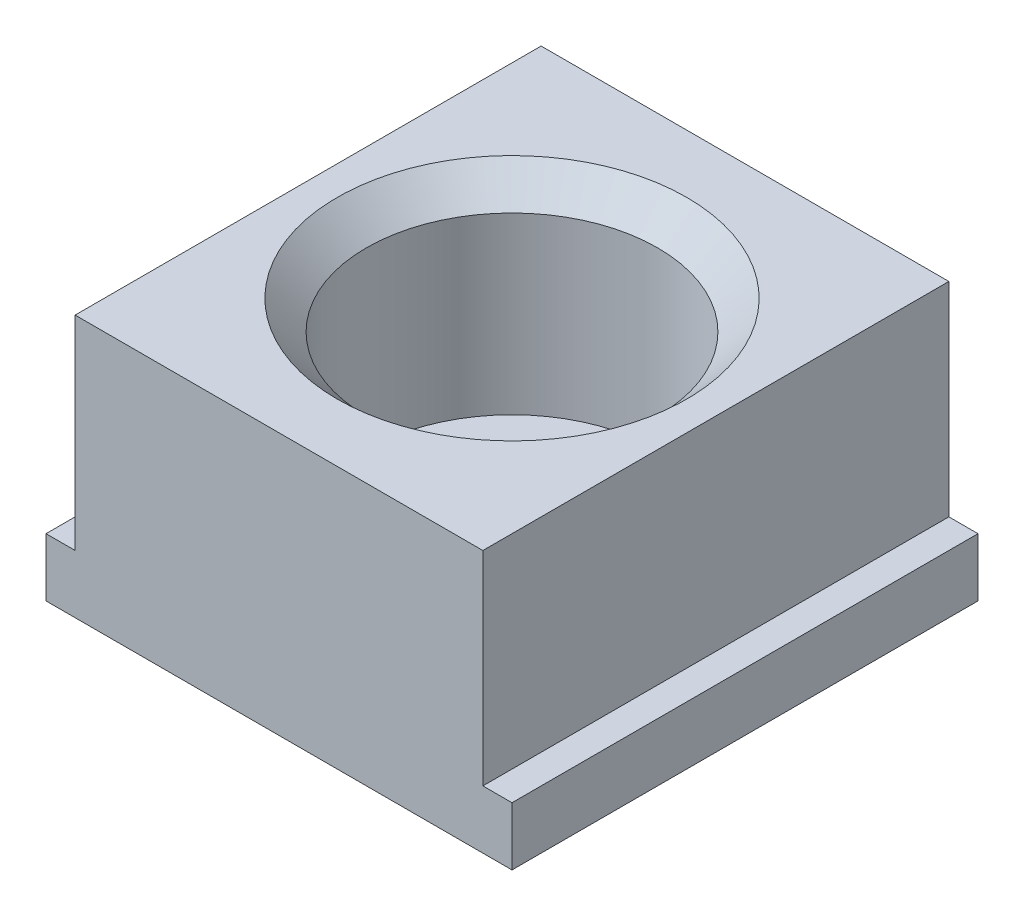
ISO-10303-21;
HEADER;
FILE_DESCRIPTION(('STEP AP214'),'2;1');
FILE_NAME('part.step','',(''),(''),'','','');
FILE_SCHEMA(('AUTOMOTIVE_DESIGN { 1 0 10303 214 1 1 1 1 }'));
ENDSEC;
DATA;
#1=APPLICATION_CONTEXT('core data for automotive mechanical design processes');
#2=APPLICATION_PROTOCOL_DEFINITION('international standard','automotive_design',2000,#1);
#3=PRODUCT_CONTEXT('',#1,'mechanical');
#4=PRODUCT('Part','Part','',(#3));
#5=PRODUCT_RELATED_PRODUCT_CATEGORY('part','',(#4));
#6=PRODUCT_DEFINITION_FORMATION('','',#4);
#7=PRODUCT_DEFINITION_CONTEXT('part definition',#1,'design');
#8=PRODUCT_DEFINITION('design','',#6,#7);
#9=PRODUCT_DEFINITION_SHAPE('','',#8);
#10=(LENGTH_UNIT() NAMED_UNIT(*) SI_UNIT(.MILLI.,.METRE.));
#11=(NAMED_UNIT(*) PLANE_ANGLE_UNIT() SI_UNIT($,.RADIAN.));
#12=(NAMED_UNIT(*) SI_UNIT($,.STERADIAN.) SOLID_ANGLE_UNIT());
#13=UNCERTAINTY_MEASURE_WITH_UNIT(LENGTH_MEASURE(1.E-05),#10,'distance_accuracy_value','');
#14=(GEOMETRIC_REPRESENTATION_CONTEXT(3) GLOBAL_UNCERTAINTY_ASSIGNED_CONTEXT((#13)) GLOBAL_UNIT_ASSIGNED_CONTEXT((#10,
#11,#12)) REPRESENTATION_CONTEXT('',''));
#15=CARTESIAN_POINT('',(0.,0.,0.));
#16=DIRECTION('',(0.,0.,1.));
#17=DIRECTION('',(1.,0.,0.));
#18=AXIS2_PLACEMENT_3D('',#15,#16,#17);
#19=CARTESIAN_POINT('',(0.,0.,7.99999999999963));
#20=DIRECTION('',(1.,0.,0.));
#21=DIRECTION('',(0.,0.,-1.));
#22=AXIS2_PLACEMENT_3D('',#19,#20,#21);
#23=PLANE('',#22);
#24=DIRECTION('',(0.,-1.,0.));
#25=VECTOR('',#24,1.);
#26=CARTESIAN_POINT('',(0.,0.,-8.00000000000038));
#27=LINE('',#26,#25);
#28=CARTESIAN_POINT('',(0.,2.,-8.00000000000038));
#29=VERTEX_POINT('',#28);
#30=CARTESIAN_POINT('',(0.,0.,-8.00000000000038));
#31=VERTEX_POINT('',#30);
#32=EDGE_CURVE('E417',#29,#31,#27,.T.);
#33=ORIENTED_EDGE('',*,*,#32,.T.);
#34=DIRECTION('',(0.,0.,-1.));
#35=VECTOR('',#34,1.);
#36=CARTESIAN_POINT('',(0.,0.,7.99999999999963));
#37=LINE('',#36,#35);
#38=CARTESIAN_POINT('',(0.,0.,7.99999999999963));
#39=VERTEX_POINT('',#38);
#40=EDGE_CURVE('E425',#39,#31,#37,.T.);
#41=ORIENTED_EDGE('',*,*,#40,.F.);
#42=DIRECTION('',(0.,-1.,0.));
#43=VECTOR('',#42,1.);
#44=CARTESIAN_POINT('',(0.,0.,7.99999999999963));
#45=LINE('',#44,#43);
#46=CARTESIAN_POINT('',(0.,2.,7.99999999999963));
#47=VERTEX_POINT('',#46);
#48=EDGE_CURVE('E453',#47,#39,#45,.T.);
#49=ORIENTED_EDGE('',*,*,#48,.F.);
#50=DIRECTION('',(0.,0.,-1.));
#51=VECTOR('',#50,1.);
#52=CARTESIAN_POINT('',(0.,2.,7.99999999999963));
#53=LINE('',#52,#51);
#54=EDGE_CURVE('E434',#47,#29,#53,.T.);
#55=ORIENTED_EDGE('',*,*,#54,.T.);
#56=EDGE_LOOP('',(#33,#41,#49,#55));
#57=FACE_BOUND('',#56,.T.);
#58=ADVANCED_FACE('F348',(#57),#23,.F.);
#59=CARTESIAN_POINT('',(0.,0.,7.99999999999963));
#60=DIRECTION('',(0.,1.,0.));
#61=DIRECTION('',(0.,0.,1.));
#62=AXIS2_PLACEMENT_3D('',#59,#60,#61);
#63=PLANE('',#62);
#64=CARTESIAN_POINT('',(7.99999999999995,0.,-3.7470027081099E-13));
#65=DIRECTION('',(0.,1.,0.));
#66=DIRECTION('',(0.,0.,1.));
#67=AXIS2_PLACEMENT_3D('',#64,#65,#66);
#68=CIRCLE('',#67,4.30000000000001);
#69=CARTESIAN_POINT('',(7.99999999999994,0.,4.29999999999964));
#70=VERTEX_POINT('',#69);
#71=EDGE_CURVE('E430',#70,#70,#68,.T.);
#72=ORIENTED_EDGE('',*,*,#71,.T.);
#73=EDGE_LOOP('',(#72));
#74=FACE_BOUND('',#73,.T.);
#75=DIRECTION('',(1.,0.,0.));
#76=VECTOR('',#75,1.);
#77=CARTESIAN_POINT('',(0.,0.,-8.00000000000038));
#78=LINE('',#77,#76);
#79=CARTESIAN_POINT('',(16.,-1.87350135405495E-13,-8.00000000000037));
#80=VERTEX_POINT('',#79);
#81=EDGE_CURVE('E412',#31,#80,#78,.T.);
#82=ORIENTED_EDGE('',*,*,#81,.T.);
#83=DIRECTION('',(0.,0.,-1.));
#84=VECTOR('',#83,1.);
#85=CARTESIAN_POINT('',(16.,0.,7.99999999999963));
#86=LINE('',#85,#84);
#87=CARTESIAN_POINT('',(16.,0.,7.99999999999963));
#88=VERTEX_POINT('',#87);
#89=EDGE_CURVE('E431',#88,#80,#86,.T.);
#90=ORIENTED_EDGE('',*,*,#89,.F.);
#91=DIRECTION('',(1.,0.,0.));
#92=VECTOR('',#91,1.);
#93=CARTESIAN_POINT('',(0.,0.,7.99999999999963));
#94=LINE('',#93,#92);
#95=EDGE_CURVE('E427',#39,#88,#94,.T.);
#96=ORIENTED_EDGE('',*,*,#95,.F.);
#97=ORIENTED_EDGE('',*,*,#40,.T.);
#98=EDGE_LOOP('',(#82,#90,#96,#97));
#99=FACE_BOUND('',#98,.T.);
#100=ADVANCED_FACE('F426',(#74,#99),#63,.F.);
#101=CARTESIAN_POINT('',(16.,0.,7.99999999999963));
#102=DIRECTION('',(-1.,0.,0.));
#103=DIRECTION('',(0.,0.,1.));
#104=AXIS2_PLACEMENT_3D('',#101,#102,#103);
#105=PLANE('',#104);
#106=DIRECTION('',(0.,1.,0.));
#107=VECTOR('',#106,1.);
#108=CARTESIAN_POINT('',(16.,-1.87350135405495E-13,-8.00000000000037));
#109=LINE('',#108,#107);
#110=CARTESIAN_POINT('',(16.,1.99999999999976,-8.00000000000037));
#111=VERTEX_POINT('',#110);
#112=EDGE_CURVE('E419',#80,#111,#109,.T.);
#113=ORIENTED_EDGE('',*,*,#112,.T.);
#114=DIRECTION('',(0.,0.,-1.));
#115=VECTOR('',#114,1.);
#116=CARTESIAN_POINT('',(16.,1.99999999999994,7.99999999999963));
#117=LINE('',#116,#115);
#118=CARTESIAN_POINT('',(16.,1.99999999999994,7.99999999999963));
#119=VERTEX_POINT('',#118);
#120=EDGE_CURVE('E479',#119,#111,#117,.T.);
#121=ORIENTED_EDGE('',*,*,#120,.F.);
#122=DIRECTION('',(0.,1.,0.));
#123=VECTOR('',#122,1.);
#124=CARTESIAN_POINT('',(16.,0.,7.99999999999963));
#125=LINE('',#124,#123);
#126=EDGE_CURVE('E456',#88,#119,#125,.T.);
#127=ORIENTED_EDGE('',*,*,#126,.F.);
#128=ORIENTED_EDGE('',*,*,#89,.T.);
#129=EDGE_LOOP('',(#113,#121,#127,#128));
#130=FACE_BOUND('',#129,.T.);
#131=ADVANCED_FACE('F509',(#130),#105,.F.);
#132=CARTESIAN_POINT('',(16.,1.99999999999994,7.99999999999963));
#133=DIRECTION('',(0.,-1.,0.));
#134=DIRECTION('',(0.,0.,-1.));
#135=AXIS2_PLACEMENT_3D('',#132,#133,#134);
#136=PLANE('',#135);
#137=DIRECTION('',(-1.,0.,0.));
#138=VECTOR('',#137,1.);
#139=CARTESIAN_POINT('',(16.,1.99999999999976,-8.00000000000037));
#140=LINE('',#139,#138);
#141=CARTESIAN_POINT('',(15.,1.99999999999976,-8.00000000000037));
#142=VERTEX_POINT('',#141);
#143=EDGE_CURVE('E443',#111,#142,#140,.T.);
#144=ORIENTED_EDGE('',*,*,#143,.T.);
#145=DIRECTION('',(0.,0.,-1.));
#146=VECTOR('',#145,1.);
#147=CARTESIAN_POINT('',(14.9999999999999,1.99999999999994,7.99999999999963));
#148=LINE('',#147,#146);
#149=CARTESIAN_POINT('',(14.9999999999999,1.99999999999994,7.99999999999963));
#150=VERTEX_POINT('',#149);
#151=EDGE_CURVE('E476',#150,#142,#148,.T.);
#152=ORIENTED_EDGE('',*,*,#151,.F.);
#153=DIRECTION('',(-1.,0.,0.));
#154=VECTOR('',#153,1.);
#155=CARTESIAN_POINT('',(16.,1.99999999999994,7.99999999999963));
#156=LINE('',#155,#154);
#157=EDGE_CURVE('E458',#119,#150,#156,.T.);
#158=ORIENTED_EDGE('',*,*,#157,.F.);
#159=ORIENTED_EDGE('',*,*,#120,.T.);
#160=EDGE_LOOP('',(#144,#152,#158,#159));
#161=FACE_BOUND('',#160,.T.);
#162=ADVANCED_FACE('F514',(#161),#136,.F.);
#163=CARTESIAN_POINT('',(14.9999999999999,9.,8.00000000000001));
#164=DIRECTION('',(-1.,0.,0.));
#165=DIRECTION('',(0.,-1.,0.));
#166=AXIS2_PLACEMENT_3D('',#163,#164,#165);
#167=PLANE('',#166);
#168=DIRECTION('',(0.,1.,0.));
#169=VECTOR('',#168,1.);
#170=CARTESIAN_POINT('',(14.9999999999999,8.99999999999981,-7.99999999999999));
#171=LINE('',#170,#169);
#172=CARTESIAN_POINT('',(14.9999999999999,8.99999999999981,-7.99999999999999));
#173=VERTEX_POINT('',#172);
#174=EDGE_CURVE('E445',#142,#173,#171,.T.);
#175=ORIENTED_EDGE('',*,*,#174,.T.);
#176=DIRECTION('',(0.,0.,-1.));
#177=VECTOR('',#176,1.);
#178=CARTESIAN_POINT('',(14.9999999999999,9.,8.00000000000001));
#179=LINE('',#178,#177);
#180=CARTESIAN_POINT('',(14.9999999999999,9.,8.00000000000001));
#181=VERTEX_POINT('',#180);
#182=EDGE_CURVE('E473',#181,#173,#179,.T.);
#183=ORIENTED_EDGE('',*,*,#182,.F.);
#184=DIRECTION('',(0.,1.,0.));
#185=VECTOR('',#184,1.);
#186=CARTESIAN_POINT('',(14.9999999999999,9.,8.00000000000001));
#187=LINE('',#186,#185);
#188=EDGE_CURVE('E460',#150,#181,#187,.T.);
#189=ORIENTED_EDGE('',*,*,#188,.F.);
#190=ORIENTED_EDGE('',*,*,#151,.T.);
#191=EDGE_LOOP('',(#175,#183,#189,#190));
#192=FACE_BOUND('',#191,.T.);
#193=ADVANCED_FACE('F520',(#192),#167,.F.);
#194=CARTESIAN_POINT('',(0.999999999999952,9.,8.00000000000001));
#195=DIRECTION('',(0.,-1.,0.));
#196=DIRECTION('',(0.,0.,-1.));
#197=AXIS2_PLACEMENT_3D('',#194,#195,#196);
#198=PLANE('',#197);
#199=CARTESIAN_POINT('',(7.99999999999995,9.,0.));
#200=DIRECTION('',(0.,-1.,0.));
#201=DIRECTION('',(0.,0.,-1.));
#202=AXIS2_PLACEMENT_3D('',#199,#200,#201);
#203=CIRCLE('',#202,6.);
#204=CARTESIAN_POINT('',(7.99999999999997,8.99999999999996,-6.));
#205=VERTEX_POINT('',#204);
#206=EDGE_CURVE('E11',#205,#205,#203,.T.);
#207=ORIENTED_EDGE('',*,*,#206,.T.);
#208=EDGE_LOOP('',(#207));
#209=FACE_BOUND('',#208,.T.);
#210=DIRECTION('',(-1.,0.,0.));
#211=VECTOR('',#210,1.);
#212=CARTESIAN_POINT('',(0.999999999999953,9.,-8.00000000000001));
#213=LINE('',#212,#211);
#214=CARTESIAN_POINT('',(0.999999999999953,9.,-8.00000000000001));
#215=VERTEX_POINT('',#214);
#216=EDGE_CURVE('E447',#173,#215,#213,.T.);
#217=ORIENTED_EDGE('',*,*,#216,.T.);
#218=DIRECTION('',(0.,0.,-1.));
#219=VECTOR('',#218,1.);
#220=CARTESIAN_POINT('',(0.999999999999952,9.,8.00000000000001));
#221=LINE('',#220,#219);
#222=CARTESIAN_POINT('',(0.999999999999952,9.,8.00000000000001));
#223=VERTEX_POINT('',#222);
#224=EDGE_CURVE('E470',#223,#215,#221,.T.);
#225=ORIENTED_EDGE('',*,*,#224,.F.);
#226=DIRECTION('',(-1.,0.,0.));
#227=VECTOR('',#226,1.);
#228=CARTESIAN_POINT('',(0.999999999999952,9.,8.00000000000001));
#229=LINE('',#228,#227);
#230=EDGE_CURVE('E462',#181,#223,#229,.T.);
#231=ORIENTED_EDGE('',*,*,#230,.F.);
#232=ORIENTED_EDGE('',*,*,#182,.T.);
#233=EDGE_LOOP('',(#217,#225,#231,#232));
#234=FACE_BOUND('',#233,.T.);
#235=ADVANCED_FACE('F524',(#209,#234),#198,.F.);
#236=CARTESIAN_POINT('',(0.999999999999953,2.,7.99999999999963));
#237=DIRECTION('',(1.,0.,0.));
#238=DIRECTION('',(0.,0.,-1.));
#239=AXIS2_PLACEMENT_3D('',#236,#237,#238);
#240=PLANE('',#239);
#241=DIRECTION('',(0.,-1.,0.));
#242=VECTOR('',#241,1.);
#243=CARTESIAN_POINT('',(0.999999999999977,1.99999999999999,-8.00000000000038));
#244=LINE('',#243,#242);
#245=CARTESIAN_POINT('',(0.999999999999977,1.99999999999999,-8.00000000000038));
#246=VERTEX_POINT('',#245);
#247=EDGE_CURVE('E449',#215,#246,#244,.T.);
#248=ORIENTED_EDGE('',*,*,#247,.T.);
#249=DIRECTION('',(0.,0.,-1.));
#250=VECTOR('',#249,1.);
#251=CARTESIAN_POINT('',(0.999999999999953,2.,7.99999999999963));
#252=LINE('',#251,#250);
#253=CARTESIAN_POINT('',(0.999999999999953,2.,7.99999999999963));
#254=VERTEX_POINT('',#253);
#255=EDGE_CURVE('E467',#254,#246,#252,.T.);
#256=ORIENTED_EDGE('',*,*,#255,.F.);
#257=DIRECTION('',(0.,-1.,0.));
#258=VECTOR('',#257,1.);
#259=CARTESIAN_POINT('',(0.999999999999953,2.,7.99999999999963));
#260=LINE('',#259,#258);
#261=EDGE_CURVE('E367',#223,#254,#260,.T.);
#262=ORIENTED_EDGE('',*,*,#261,.F.);
#263=ORIENTED_EDGE('',*,*,#224,.T.);
#264=EDGE_LOOP('',(#248,#256,#262,#263));
#265=FACE_BOUND('',#264,.T.);
#266=ADVANCED_FACE('F528',(#265),#240,.F.);
#267=CARTESIAN_POINT('',(0.,2.,7.99999999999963));
#268=DIRECTION('',(0.,-1.,0.));
#269=DIRECTION('',(0.,0.,-1.));
#270=AXIS2_PLACEMENT_3D('',#267,#268,#269);
#271=PLANE('',#270);
#272=DIRECTION('',(-1.,0.,0.));
#273=VECTOR('',#272,1.);
#274=CARTESIAN_POINT('',(0.,2.,-8.00000000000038));
#275=LINE('',#274,#273);
#276=EDGE_CURVE('E451',#246,#29,#275,.T.);
#277=ORIENTED_EDGE('',*,*,#276,.T.);
#278=ORIENTED_EDGE('',*,*,#54,.F.);
#279=DIRECTION('',(-1.,0.,0.));
#280=VECTOR('',#279,1.);
#281=CARTESIAN_POINT('',(0.,2.,7.99999999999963));
#282=LINE('',#281,#280);
#283=EDGE_CURVE('E362',#254,#47,#282,.T.);
#284=ORIENTED_EDGE('',*,*,#283,.F.);
#285=ORIENTED_EDGE('',*,*,#255,.T.);
#286=EDGE_LOOP('',(#277,#278,#284,#285));
#287=FACE_BOUND('',#286,.T.);
#288=ADVANCED_FACE('F532',(#287),#271,.F.);
#289=CARTESIAN_POINT('',(0.,2.,7.99999999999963));
#290=DIRECTION('',(0.,0.,-1.));
#291=DIRECTION('',(-1.,0.,0.));
#292=AXIS2_PLACEMENT_3D('',#289,#290,#291);
#293=PLANE('',#292);
#294=ORIENTED_EDGE('',*,*,#48,.T.);
#295=ORIENTED_EDGE('',*,*,#95,.T.);
#296=ORIENTED_EDGE('',*,*,#126,.T.);
#297=ORIENTED_EDGE('',*,*,#157,.T.);
#298=ORIENTED_EDGE('',*,*,#188,.T.);
#299=ORIENTED_EDGE('',*,*,#230,.T.);
#300=ORIENTED_EDGE('',*,*,#261,.T.);
#301=ORIENTED_EDGE('',*,*,#283,.T.);
#302=EDGE_LOOP('',(#294,#295,#296,#297,#298,#299,#300,#301));
#303=FACE_BOUND('',#302,.T.);
#304=ADVANCED_FACE('F536',(#303),#293,.F.);
#305=CARTESIAN_POINT('',(0.,2.,-8.00000000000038));
#306=DIRECTION('',(0.,0.,-1.));
#307=DIRECTION('',(-1.,0.,0.));
#308=AXIS2_PLACEMENT_3D('',#305,#306,#307);
#309=PLANE('',#308);
#310=ORIENTED_EDGE('',*,*,#32,.F.);
#311=ORIENTED_EDGE('',*,*,#276,.F.);
#312=ORIENTED_EDGE('',*,*,#247,.F.);
#313=ORIENTED_EDGE('',*,*,#216,.F.);
#314=ORIENTED_EDGE('',*,*,#174,.F.);
#315=ORIENTED_EDGE('',*,*,#143,.F.);
#316=ORIENTED_EDGE('',*,*,#112,.F.);
#317=ORIENTED_EDGE('',*,*,#81,.F.);
#318=EDGE_LOOP('',(#310,#311,#312,#313,#314,#315,#316,#317));
#319=FACE_BOUND('',#318,.T.);
#320=ADVANCED_FACE('F414',(#319),#309,.T.);
#321=CARTESIAN_POINT('',(7.99999999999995,9.,0.));
#322=DIRECTION('',(0.,1.,0.));
#323=DIRECTION('',(0.,0.,1.));
#324=AXIS2_PLACEMENT_3D('',#321,#322,#323);
#325=CYLINDRICAL_SURFACE('',#324,3.3);
#326=CARTESIAN_POINT('',(7.99999999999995,1.,-3.7470027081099E-13));
#327=DIRECTION('',(0.,1.,0.));
#328=DIRECTION('',(0.,0.,1.));
#329=AXIS2_PLACEMENT_3D('',#326,#327,#328);
#330=CIRCLE('',#329,3.3);
#331=CARTESIAN_POINT('',(7.99999999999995,1.00000000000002,3.29999999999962));
#332=VERTEX_POINT('',#331);
#333=EDGE_CURVE('E485',#332,#332,#330,.F.);
#334=ORIENTED_EDGE('',*,*,#333,.T.);
#335=EDGE_LOOP('',(#334));
#336=FACE_BOUND('',#335,.T.);
#337=CARTESIAN_POINT('',(7.99999999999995,2.,-3.7470027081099E-13));
#338=DIRECTION('',(0.,1.,0.));
#339=DIRECTION('',(0.,0.,1.));
#340=AXIS2_PLACEMENT_3D('',#337,#338,#339);
#341=CIRCLE('',#340,3.3);
#342=CARTESIAN_POINT('',(7.99999999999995,2.00000000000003,3.29999999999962));
#343=VERTEX_POINT('',#342);
#344=EDGE_CURVE('E438',#343,#343,#341,.T.);
#345=ORIENTED_EDGE('',*,*,#344,.T.);
#346=EDGE_LOOP('',(#345));
#347=FACE_BOUND('',#346,.T.);
#348=ADVANCED_FACE('F542',(#336,#347),#325,.F.);
#349=CARTESIAN_POINT('',(7.99999999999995,9.,0.));
#350=DIRECTION('',(0.,1.,0.));
#351=DIRECTION('',(0.,0.,1.));
#352=AXIS2_PLACEMENT_3D('',#349,#350,#351);
#353=CYLINDRICAL_SURFACE('',#352,5.);
#354=CARTESIAN_POINT('',(7.99999999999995,8.,0.));
#355=DIRECTION('',(0.,-1.,0.));
#356=DIRECTION('',(0.,0.,-1.));
#357=AXIS2_PLACEMENT_3D('',#354,#355,#356);
#358=CIRCLE('',#357,5.);
#359=CARTESIAN_POINT('',(7.99999999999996,7.99999999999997,-5.));
#360=VERTEX_POINT('',#359);
#361=EDGE_CURVE('E355',#360,#360,#358,.F.);
#362=ORIENTED_EDGE('',*,*,#361,.T.);
#363=EDGE_LOOP('',(#362));
#364=FACE_BOUND('',#363,.T.);
#365=CARTESIAN_POINT('',(7.99999999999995,2.,-3.7470027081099E-13));
#366=DIRECTION('',(0.,1.,0.));
#367=DIRECTION('',(0.,0.,1.));
#368=AXIS2_PLACEMENT_3D('',#365,#366,#367);
#369=CIRCLE('',#368,5.);
#370=CARTESIAN_POINT('',(7.99999999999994,2.00000000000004,4.99999999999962));
#371=VERTEX_POINT('',#370);
#372=EDGE_CURVE('E435',#371,#371,#369,.T.);
#373=ORIENTED_EDGE('',*,*,#372,.F.);
#374=EDGE_LOOP('',(#373));
#375=FACE_BOUND('',#374,.T.);
#376=ADVANCED_FACE('F490',(#364,#375),#353,.F.);
#377=CARTESIAN_POINT('',(11.3,2.,-3.7470027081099E-13));
#378=DIRECTION('',(0.,-1.,0.));
#379=DIRECTION('',(0.,0.,-1.));
#380=AXIS2_PLACEMENT_3D('',#377,#378,#379);
#381=PLANE('',#380);
#382=ORIENTED_EDGE('',*,*,#344,.F.);
#383=EDGE_LOOP('',(#382));
#384=FACE_BOUND('',#383,.T.);
#385=ORIENTED_EDGE('',*,*,#372,.T.);
#386=EDGE_LOOP('',(#385));
#387=FACE_BOUND('',#386,.T.);
#388=ADVANCED_FACE('F501',(#384,#387),#381,.F.);
#389=CARTESIAN_POINT('',(7.99999999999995,0.,-3.7470027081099E-13));
#390=DIRECTION('',(0.,-1.,0.));
#391=DIRECTION('',(0.,0.,-1.));
#392=AXIS2_PLACEMENT_3D('',#389,#390,#391);
#393=CONICAL_SURFACE('',#392,4.30000000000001,0.785398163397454);
#394=ORIENTED_EDGE('',*,*,#333,.F.);
#395=EDGE_LOOP('',(#394));
#396=FACE_BOUND('',#395,.T.);
#397=ORIENTED_EDGE('',*,*,#71,.F.);
#398=EDGE_LOOP('',(#397));
#399=FACE_BOUND('',#398,.T.);
#400=ADVANCED_FACE('F495',(#396,#399),#393,.F.);
#401=CARTESIAN_POINT('',(7.99999999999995,8.,0.));
#402=DIRECTION('',(0.,1.,0.));
#403=DIRECTION('',(0.,0.,1.));
#404=AXIS2_PLACEMENT_3D('',#401,#402,#403);
#405=CONICAL_SURFACE('',#404,5.,0.78539816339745);
#406=ORIENTED_EDGE('',*,*,#206,.F.);
#407=EDGE_LOOP('',(#406));
#408=FACE_BOUND('',#407,.T.);
#409=ORIENTED_EDGE('',*,*,#361,.F.);
#410=EDGE_LOOP('',(#409));
#411=FACE_BOUND('',#410,.T.);
#412=ADVANCED_FACE('F493',(#408,#411),#405,.F.);
#413=CLOSED_SHELL('',(#58,#100,#131,#162,#193,#235,#266,#288,#304,#320,#348,#376,#388,#400,#412));
#414=MANIFOLD_SOLID_BREP('B2',#413);
#415=ADVANCED_BREP_SHAPE_REPRESENTATION('',(#18,#414),#14);
#416=SHAPE_DEFINITION_REPRESENTATION(#9,#415);
ENDSEC;
END-ISO-10303-21;
